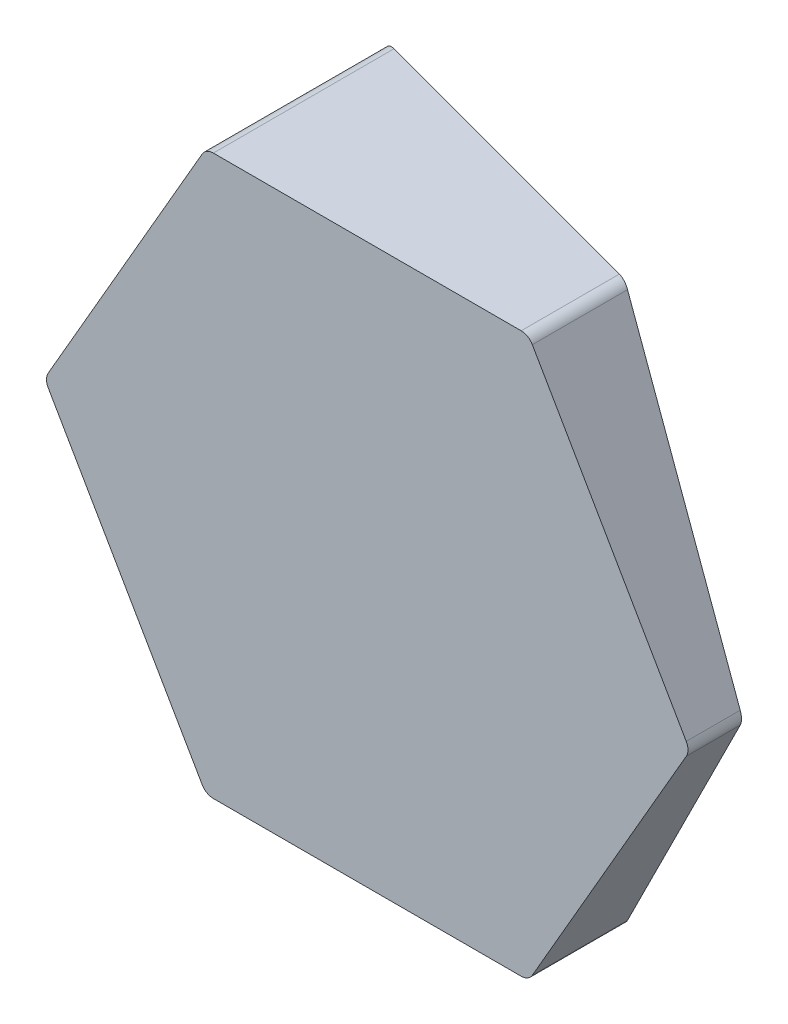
from build123d import *

# Parameters (mm, degrees)
BOSS_EXTRUDE1_DEPTH     = 35
CUT_EXTRUDE1_DEPTH      = 75.833147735
CUT_EXTRUDE1_DEPTH_BACK = 75.833147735
FILLET2_R               = 2


with BuildPart() as part:
    # Sketch1 → Boss-Extrude1 (new body)
    with BuildSketch(Plane.XY):
        Polygon((50, 0), (25, 43.301270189), (-25, 43.301270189), (-50, 0), (-25, -43.301270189), (25, -43.301270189), align=None)
    extrude(amount=BOSS_EXTRUDE1_DEPTH)

    # Sketch2 → Cut-Extrude1 (cut, two sides: drawn at the far end of the back side and taken through both)
    with BuildSketch(Plane(origin=(0, 0, 0), x_dir=(1, 0, 0), z_dir=(0, 1, 0)).offset(-CUT_EXTRUDE1_DEPTH_BACK)):
        Polygon((-50, 0), (50, -26.794919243), (50, 0), align=None)
    extrude(amount=CUT_EXTRUDE1_DEPTH + CUT_EXTRUDE1_DEPTH_BACK, mode=Mode.SUBTRACT)

    # Fillet2
    fillet2_edges = [part.edges().sort_by_distance(p)[0] for p in [
        (25, -43.301270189, 27.548094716),
        (-25, -43.301270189, 20.849364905),
        (-50, 0, 17.5),
        (-25, 43.301270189, 20.849364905),
        (25, 43.301270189, 27.548094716),
        (50, 0, 30.897459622),
    ]]
    fillet(fillet2_edges, radius=FILLET2_R)


solid = part.part
